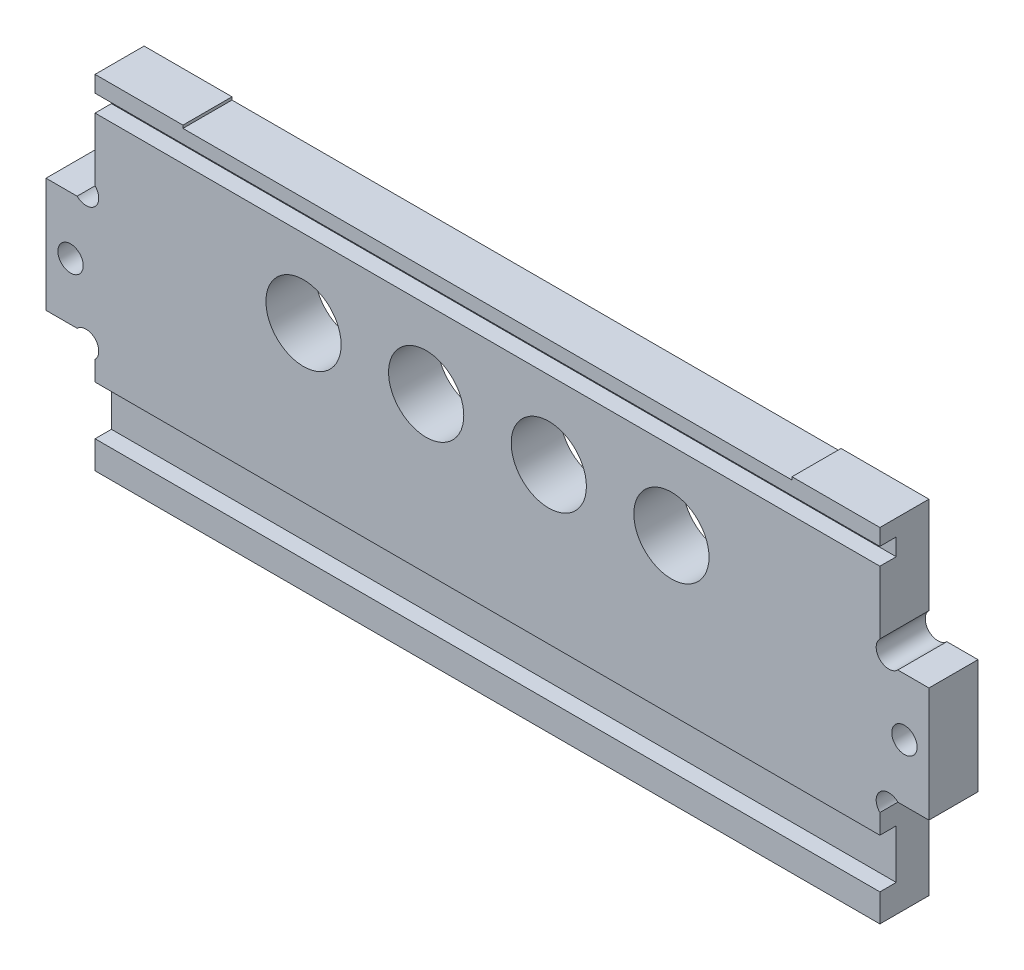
from build123d import *

# Parameters (mm, degrees)
ESQUISSE1_R             = 4.6
ESQUISSE1_R_2           = 1.55
EXTRUSION1_DEPTH        = 6
ESQUISSE2_W             = 142
ESQUISSE2_H             = 2.10000947
ESQUISSE2_H_2           = 6
ENL_V_MAT_EXTRU_1_DEPTH = 2


with BuildPart() as part:
    # Esquisse1 → Extrusion1 (new body)
    with BuildSketch(Plane.XY):
        with BuildLine():
            Line((6, 42), (16.75, 42))
            Line((16.75, 42), (16.75, 41.65))
            Line((16.75, 41.65), (91.25, 41.65))
            Line((91.25, 41.65), (91.25, 42))
            Line((91.25, 42), (102, 42))
            Line((102, 42), (102, 30.192031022))
            ThreePointArc((102, 30.192031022), (102, 28), (104.192031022, 28))
            Line((104.192031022, 28), (108, 28))
            Line((108, 28), (108, 14))
            Line((108, 14), (104.192031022, 14))
            ThreePointArc((104.192031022, 14), (102, 14), (102, 11.807968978))
            Line((102, 11.807968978), (102, 0))
            Line((102, 0), (6, 0))
            Line((6, 0), (6, 11.807968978))
            ThreePointArc((6, 11.807968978), (6, 14), (3.807968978, 14))
            Line((3.807968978, 14), (0, 14))
            Line((0, 14), (0, 28))
            Line((0, 28), (3.807968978, 28))
            ThreePointArc((3.807968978, 28), (6, 28), (6, 30.192031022))
            Line((6, 30.192031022), (6, 42))
        make_face()
        with Locations((31.5, 28.4)):
            Circle(ESQUISSE1_R, mode=Mode.SUBTRACT)
        with Locations((3, 21)):
            Circle(ESQUISSE1_R_2, mode=Mode.SUBTRACT)
        with Locations(Location((105, 21, 0), (0, 0, 180))):
            Circle(ESQUISSE1_R_2, mode=Mode.SUBTRACT)
        with Locations((46.5, 28.4)):
            Circle(ESQUISSE1_R, mode=Mode.SUBTRACT)
        with Locations((61.5, 28.4)):
            Circle(ESQUISSE1_R, mode=Mode.SUBTRACT)
        with Locations((76.5, 28.4)):
            Circle(ESQUISSE1_R, mode=Mode.SUBTRACT)
    extrude(amount=EXTRUSION1_DEPTH)

    # Esquisse2 → Enl_v. mat.-Extru.1 (cut)
    with BuildSketch(Plane.XY.offset(6)):
        with Locations((74, 38.949995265)):
            Rectangle(ESQUISSE2_W, ESQUISSE2_H)
        with Locations((74, 6.4)):
            Rectangle(ESQUISSE2_W, ESQUISSE2_H_2)
    extrude(amount=-ENL_V_MAT_EXTRU_1_DEPTH, mode=Mode.SUBTRACT)


solid = part.part
